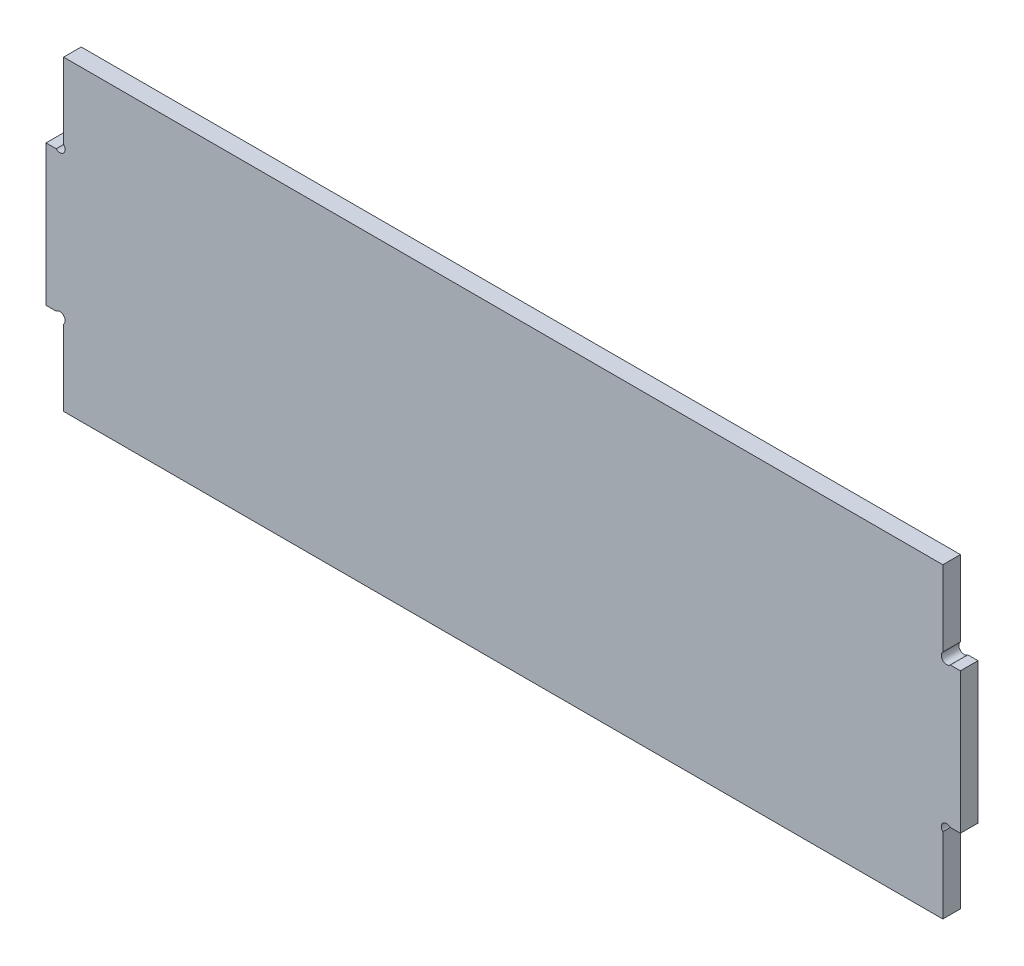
from build123d import *

# Parameters (mm, degrees)
CROQUIS3_W              = 500
CROQUIS3_H              = 174.495448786
SALIENTE_EXTRUIR3_DEPTH = 10
CROQUIS4_W              = 10
CROQUIS4_H              = 80
SALIENTE_EXTRUIR4_DEPTH = 10
CROQUIS5_R              = 3
CORTAR_EXTRUIR1_DEPTH   = 539.84208782


with BuildPart() as part:
    # Croquis3 → Saliente-Extruir3 (new body)
    with BuildSketch(Plane.XY.offset(10)):
        with Locations((-250, 86.39212013)):
            Rectangle(CROQUIS3_W, CROQUIS3_H)
    extrude(amount=-SALIENTE_EXTRUIR3_DEPTH)

    # Croquis4 → Saliente-Extruir4 (add)
    with BuildSketch(Plane.ZY.offset(500)):
        with Locations((5, 86.39212013)):
            Rectangle(CROQUIS4_W, CROQUIS4_H)
    saliente_extruir4 = extrude(amount=SALIENTE_EXTRUIR4_DEPTH)

    # Croquis5 → Cortar-Extruir1 (cut, symmetric)
    with BuildSketch(Plane.XY.offset(10)):
        with Locations((-502.121320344, 128.513440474)):
            Circle(CROQUIS5_R)
        with Locations((-502.121320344, 44.270799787)):
            Circle(CROQUIS5_R)
    cortar_extruir1 = extrude(amount=CORTAR_EXTRUIR1_DEPTH, both=True, mode=Mode.SUBTRACT)

    # Simetr_a1: Saliente-Extruir4, Cortar-Extruir1 across plane
    add(saliente_extruir4.mirror(Plane.ZY.offset(250)))
    add(cortar_extruir1.mirror(Plane.ZY.offset(250)), mode=Mode.SUBTRACT)


solid = part.part
